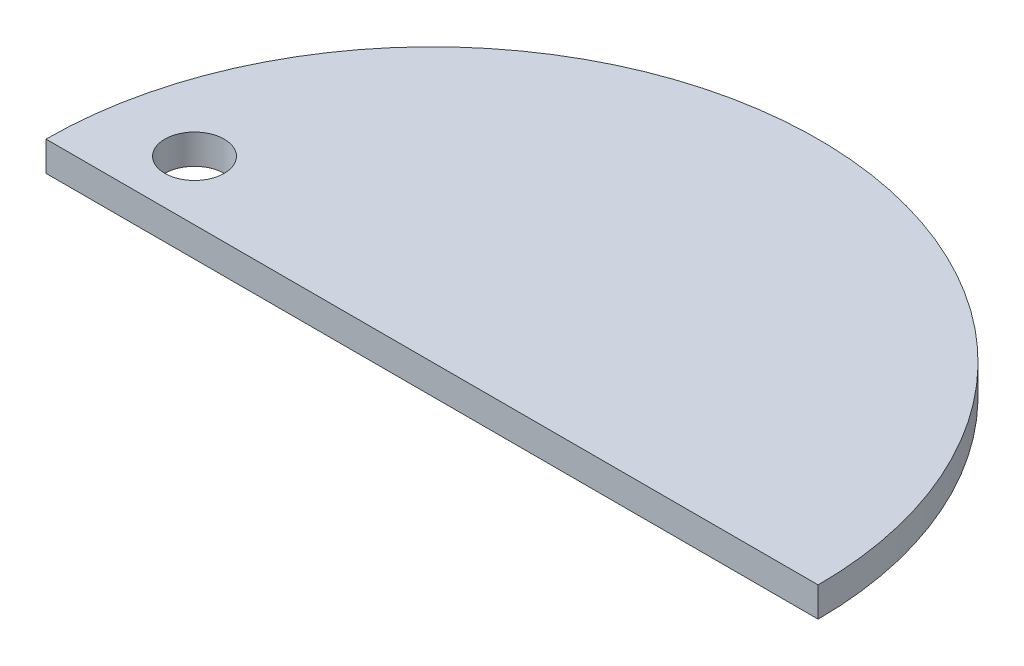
ISO-10303-21;
HEADER;
FILE_DESCRIPTION(('STEP AP214'),'2;1');
FILE_NAME('part.step','',(''),(''),'','','');
FILE_SCHEMA(('AUTOMOTIVE_DESIGN { 1 0 10303 214 1 1 1 1 }'));
ENDSEC;
DATA;
#1=APPLICATION_CONTEXT('core data for automotive mechanical design processes');
#2=APPLICATION_PROTOCOL_DEFINITION('international standard','automotive_design',2000,#1);
#3=PRODUCT_CONTEXT('',#1,'mechanical');
#4=PRODUCT('Part','Part','',(#3));
#5=PRODUCT_RELATED_PRODUCT_CATEGORY('part','',(#4));
#6=PRODUCT_DEFINITION_FORMATION('','',#4);
#7=PRODUCT_DEFINITION_CONTEXT('part definition',#1,'design');
#8=PRODUCT_DEFINITION('design','',#6,#7);
#9=PRODUCT_DEFINITION_SHAPE('','',#8);
#10=(LENGTH_UNIT() NAMED_UNIT(*) SI_UNIT(.MILLI.,.METRE.));
#11=(NAMED_UNIT(*) PLANE_ANGLE_UNIT() SI_UNIT($,.RADIAN.));
#12=(NAMED_UNIT(*) SI_UNIT($,.STERADIAN.) SOLID_ANGLE_UNIT());
#13=UNCERTAINTY_MEASURE_WITH_UNIT(LENGTH_MEASURE(1.E-05),#10,'distance_accuracy_value','');
#14=(GEOMETRIC_REPRESENTATION_CONTEXT(3) GLOBAL_UNCERTAINTY_ASSIGNED_CONTEXT((#13)) GLOBAL_UNIT_ASSIGNED_CONTEXT((#10,
#11,#12)) REPRESENTATION_CONTEXT('',''));
#15=CARTESIAN_POINT('',(0.,0.,0.));
#16=DIRECTION('',(0.,0.,1.));
#17=DIRECTION('',(1.,0.,0.));
#18=AXIS2_PLACEMENT_3D('',#15,#16,#17);
#19=CARTESIAN_POINT('',(-10.,5.,50.));
#20=DIRECTION('',(0.,-1.,0.));
#21=DIRECTION('',(0.,0.,-1.));
#22=AXIS2_PLACEMENT_3D('',#19,#20,#21);
#23=CYLINDRICAL_SURFACE('',#22,65.);
#24=CARTESIAN_POINT('',(-10.,0.,50.));
#25=DIRECTION('',(0.,1.,0.));
#26=DIRECTION('',(0.,0.,1.));
#27=AXIS2_PLACEMENT_3D('',#24,#25,#26);
#28=CIRCLE('',#27,65.);
#29=CARTESIAN_POINT('',(-75.,0.,50.));
#30=VERTEX_POINT('',#29);
#31=CARTESIAN_POINT('',(55.,0.,50.));
#32=VERTEX_POINT('',#31);
#33=EDGE_CURVE('E58',#30,#32,#28,.F.);
#34=ORIENTED_EDGE('',*,*,#33,.F.);
#35=DIRECTION('',(0.,-1.,0.));
#36=VECTOR('',#35,1.);
#37=CARTESIAN_POINT('',(-75.,5.,50.));
#38=LINE('',#37,#36);
#39=CARTESIAN_POINT('',(-75.,5.,50.));
#40=VERTEX_POINT('',#39);
#41=EDGE_CURVE('E11',#40,#30,#38,.T.);
#42=ORIENTED_EDGE('',*,*,#41,.F.);
#43=CARTESIAN_POINT('',(-10.,5.,50.));
#44=DIRECTION('',(0.,1.,0.));
#45=DIRECTION('',(0.,0.,1.));
#46=AXIS2_PLACEMENT_3D('',#43,#44,#45);
#47=CIRCLE('',#46,65.);
#48=CARTESIAN_POINT('',(55.,5.,50.));
#49=VERTEX_POINT('',#48);
#50=EDGE_CURVE('E61',#40,#49,#47,.F.);
#51=ORIENTED_EDGE('',*,*,#50,.T.);
#52=DIRECTION('',(0.,-1.,0.));
#53=VECTOR('',#52,1.);
#54=CARTESIAN_POINT('',(55.,5.,50.));
#55=LINE('',#54,#53);
#56=EDGE_CURVE('E43',#49,#32,#55,.T.);
#57=ORIENTED_EDGE('',*,*,#56,.T.);
#58=EDGE_LOOP('',(#34,#42,#51,#57));
#59=FACE_BOUND('',#58,.T.);
#60=ADVANCED_FACE('F35',(#59),#23,.T.);
#61=CARTESIAN_POINT('',(0.,5.,50.));
#62=DIRECTION('',(0.,0.,1.));
#63=DIRECTION('',(1.,0.,0.));
#64=AXIS2_PLACEMENT_3D('',#61,#62,#63);
#65=PLANE('',#64);
#66=DIRECTION('',(-1.,0.,0.));
#67=VECTOR('',#66,1.);
#68=CARTESIAN_POINT('',(0.,0.,50.));
#69=LINE('',#68,#67);
#70=EDGE_CURVE('E67',#32,#30,#69,.T.);
#71=ORIENTED_EDGE('',*,*,#70,.F.);
#72=ORIENTED_EDGE('',*,*,#56,.F.);
#73=DIRECTION('',(-1.,0.,0.));
#74=VECTOR('',#73,1.);
#75=CARTESIAN_POINT('',(0.,5.,50.));
#76=LINE('',#75,#74);
#77=EDGE_CURVE('E77',#49,#40,#76,.T.);
#78=ORIENTED_EDGE('',*,*,#77,.T.);
#79=ORIENTED_EDGE('',*,*,#41,.T.);
#80=EDGE_LOOP('',(#71,#72,#78,#79));
#81=FACE_BOUND('',#80,.T.);
#82=ADVANCED_FACE('F69',(#81),#65,.T.);
#83=CARTESIAN_POINT('',(-60.,5.,40.));
#84=DIRECTION('',(0.,-1.,0.));
#85=DIRECTION('',(0.,0.,-1.));
#86=AXIS2_PLACEMENT_3D('',#83,#84,#85);
#87=CYLINDRICAL_SURFACE('',#86,5.00000000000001);
#88=CARTESIAN_POINT('',(-60.,5.,40.));
#89=DIRECTION('',(0.,1.,0.));
#90=DIRECTION('',(0.,0.,1.));
#91=AXIS2_PLACEMENT_3D('',#88,#89,#90);
#92=CIRCLE('',#91,5.00000000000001);
#93=CARTESIAN_POINT('',(-60.,5.,45.));
#94=VERTEX_POINT('',#93);
#95=EDGE_CURVE('E63',#94,#94,#92,.T.);
#96=ORIENTED_EDGE('',*,*,#95,.T.);
#97=EDGE_LOOP('',(#96));
#98=FACE_BOUND('',#97,.T.);
#99=CARTESIAN_POINT('',(-60.,0.,40.));
#100=DIRECTION('',(0.,1.,0.));
#101=DIRECTION('',(0.,0.,1.));
#102=AXIS2_PLACEMENT_3D('',#99,#100,#101);
#103=CIRCLE('',#102,5.00000000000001);
#104=CARTESIAN_POINT('',(-60.,0.,45.));
#105=VERTEX_POINT('',#104);
#106=EDGE_CURVE('E70',#105,#105,#103,.T.);
#107=ORIENTED_EDGE('',*,*,#106,.F.);
#108=EDGE_LOOP('',(#107));
#109=FACE_BOUND('',#108,.T.);
#110=ADVANCED_FACE('F83',(#98,#109),#87,.F.);
#111=CARTESIAN_POINT('',(0.,5.,0.));
#112=DIRECTION('',(0.,1.,0.));
#113=DIRECTION('',(0.,0.,1.));
#114=AXIS2_PLACEMENT_3D('',#111,#112,#113);
#115=PLANE('',#114);
#116=ORIENTED_EDGE('',*,*,#50,.F.);
#117=ORIENTED_EDGE('',*,*,#77,.F.);
#118=EDGE_LOOP('',(#116,#117));
#119=FACE_BOUND('',#118,.T.);
#120=ORIENTED_EDGE('',*,*,#95,.F.);
#121=EDGE_LOOP('',(#120));
#122=FACE_BOUND('',#121,.T.);
#123=ADVANCED_FACE('F80',(#119,#122),#115,.T.);
#124=CARTESIAN_POINT('',(0.,0.,0.));
#125=DIRECTION('',(0.,1.,0.));
#126=DIRECTION('',(0.,0.,1.));
#127=AXIS2_PLACEMENT_3D('',#124,#125,#126);
#128=PLANE('',#127);
#129=ORIENTED_EDGE('',*,*,#33,.T.);
#130=ORIENTED_EDGE('',*,*,#70,.T.);
#131=EDGE_LOOP('',(#129,#130));
#132=FACE_BOUND('',#131,.T.);
#133=ORIENTED_EDGE('',*,*,#106,.T.);
#134=EDGE_LOOP('',(#133));
#135=FACE_BOUND('',#134,.T.);
#136=ADVANCED_FACE('F65',(#132,#135),#128,.F.);
#137=CLOSED_SHELL('',(#60,#82,#110,#123,#136));
#138=MANIFOLD_SOLID_BREP('B2',#137);
#139=ADVANCED_BREP_SHAPE_REPRESENTATION('',(#18,#138),#14);
#140=SHAPE_DEFINITION_REPRESENTATION(#9,#139);
ENDSEC;
END-ISO-10303-21;
